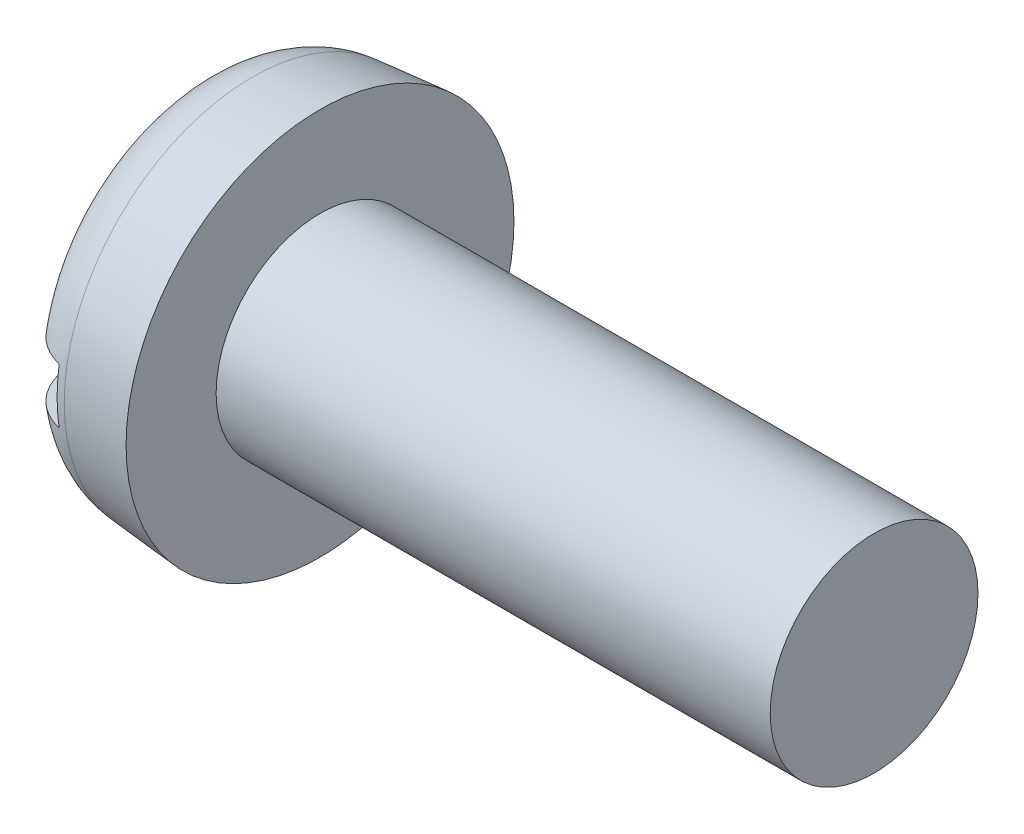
ISO-10303-21;
HEADER;
FILE_DESCRIPTION(('STEP AP214'),'2;1');
FILE_NAME('part.step','',(''),(''),'','','');
FILE_SCHEMA(('AUTOMOTIVE_DESIGN { 1 0 10303 214 1 1 1 1 }'));
ENDSEC;
DATA;
#1=APPLICATION_CONTEXT('core data for automotive mechanical design processes');
#2=APPLICATION_PROTOCOL_DEFINITION('international standard','automotive_design',2000,#1);
#3=PRODUCT_CONTEXT('',#1,'mechanical');
#4=PRODUCT('Part','Part','',(#3));
#5=PRODUCT_RELATED_PRODUCT_CATEGORY('part','',(#4));
#6=PRODUCT_DEFINITION_FORMATION('','',#4);
#7=PRODUCT_DEFINITION_CONTEXT('part definition',#1,'design');
#8=PRODUCT_DEFINITION('design','',#6,#7);
#9=PRODUCT_DEFINITION_SHAPE('','',#8);
#10=(LENGTH_UNIT() NAMED_UNIT(*) SI_UNIT(.MILLI.,.METRE.));
#11=(NAMED_UNIT(*) PLANE_ANGLE_UNIT() SI_UNIT($,.RADIAN.));
#12=(NAMED_UNIT(*) SI_UNIT($,.STERADIAN.) SOLID_ANGLE_UNIT());
#13=UNCERTAINTY_MEASURE_WITH_UNIT(LENGTH_MEASURE(1.E-05),#10,'distance_accuracy_value','');
#14=(GEOMETRIC_REPRESENTATION_CONTEXT(3) GLOBAL_UNCERTAINTY_ASSIGNED_CONTEXT((#13)) GLOBAL_UNIT_ASSIGNED_CONTEXT((#10,
#11,#12)) REPRESENTATION_CONTEXT('',''));
#15=CARTESIAN_POINT('',(0.,0.,0.));
#16=DIRECTION('',(0.,0.,1.));
#17=DIRECTION('',(1.,0.,0.));
#18=AXIS2_PLACEMENT_3D('',#15,#16,#17);
#19=CARTESIAN_POINT('',(0.,0.,0.));
#20=DIRECTION('',(-1.,0.,0.));
#21=DIRECTION('',(0.,0.,1.));
#22=AXIS2_PLACEMENT_3D('',#19,#20,#21);
#23=PLANE('',#22);
#24=DIRECTION('',(0.,0.,-1.));
#25=VECTOR('',#24,1.);
#26=CARTESIAN_POINT('',(0.,0.399999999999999,2.8));
#27=LINE('',#26,#25);
#28=CARTESIAN_POINT('',(0.,0.399999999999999,1.77326763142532));
#29=VERTEX_POINT('',#28);
#30=CARTESIAN_POINT('',(0.,0.399999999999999,-1.77326763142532));
#31=VERTEX_POINT('',#30);
#32=EDGE_CURVE('E85',#29,#31,#27,.T.);
#33=ORIENTED_EDGE('',*,*,#32,.F.);
#34=CARTESIAN_POINT('',(0.,0.,0.));
#35=DIRECTION('',(-1.,0.,0.));
#36=DIRECTION('',(0.,0.,1.));
#37=AXIS2_PLACEMENT_3D('',#34,#35,#36);
#38=CIRCLE('',#37,1.81782234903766);
#39=EDGE_CURVE('E91',#29,#31,#38,.T.);
#40=ORIENTED_EDGE('',*,*,#39,.T.);
#41=EDGE_LOOP('',(#33,#40));
#42=FACE_BOUND('',#41,.T.);
#43=ADVANCED_FACE('F32',(#42),#23,.T.);
#44=CARTESIAN_POINT('',(-25.4,0.,0.));
#45=DIRECTION('',(-1.,0.,0.));
#46=DIRECTION('',(0.,0.,1.));
#47=AXIS2_PLACEMENT_3D('',#44,#45,#46);
#48=CYLINDRICAL_SURFACE('',#47,1.5);
#49=CARTESIAN_POINT('',(9.8,0.,0.));
#50=DIRECTION('',(-1.,0.,0.));
#51=DIRECTION('',(0.,0.,1.));
#52=AXIS2_PLACEMENT_3D('',#49,#50,#51);
#53=CIRCLE('',#52,1.5);
#54=CARTESIAN_POINT('',(9.8,0.,1.5));
#55=VERTEX_POINT('',#54);
#56=EDGE_CURVE('E92',#55,#55,#53,.T.);
#57=ORIENTED_EDGE('',*,*,#56,.T.);
#58=EDGE_LOOP('',(#57));
#59=FACE_BOUND('',#58,.T.);
#60=CARTESIAN_POINT('',(1.8,0.,0.));
#61=DIRECTION('',(-1.,0.,0.));
#62=DIRECTION('',(0.,0.,1.));
#63=AXIS2_PLACEMENT_3D('',#60,#61,#62);
#64=CIRCLE('',#63,1.5);
#65=CARTESIAN_POINT('',(1.8,0.,1.5));
#66=VERTEX_POINT('',#65);
#67=EDGE_CURVE('E149',#66,#66,#64,.T.);
#68=ORIENTED_EDGE('',*,*,#67,.F.);
#69=EDGE_LOOP('',(#68));
#70=FACE_BOUND('',#69,.T.);
#71=ADVANCED_FACE('F137',(#59,#70),#48,.T.);
#72=CARTESIAN_POINT('',(9.8,1.5,0.));
#73=DIRECTION('',(1.,0.,0.));
#74=DIRECTION('',(0.,0.,-1.));
#75=AXIS2_PLACEMENT_3D('',#72,#73,#74);
#76=PLANE('',#75);
#77=ORIENTED_EDGE('',*,*,#56,.F.);
#78=EDGE_LOOP('',(#77));
#79=FACE_BOUND('',#78,.T.);
#80=ADVANCED_FACE('F135',(#79),#76,.T.);
#81=DIRECTION('',(0.,0.,1.));
#82=VECTOR('',#81,1.);
#83=CARTESIAN_POINT('',(0.,-0.4,-2.8));
#84=LINE('',#83,#82);
#85=CARTESIAN_POINT('',(0.,-0.4,-1.77326763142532));
#86=VERTEX_POINT('',#85);
#87=CARTESIAN_POINT('',(0.,-0.4,1.77326763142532));
#88=VERTEX_POINT('',#87);
#89=EDGE_CURVE('E76',#86,#88,#84,.T.);
#90=ORIENTED_EDGE('',*,*,#89,.F.);
#91=EDGE_CURVE('E83',#86,#88,#38,.T.);
#92=ORIENTED_EDGE('',*,*,#91,.T.);
#93=EDGE_LOOP('',(#90,#92));
#94=FACE_BOUND('',#93,.T.);
#95=ADVANCED_FACE('F82',(#94),#23,.T.);
#96=CARTESIAN_POINT('',(0.,0.,0.));
#97=DIRECTION('',(1.,0.,0.));
#98=DIRECTION('',(0.,0.,-1.));
#99=AXIS2_PLACEMENT_3D('',#96,#97,#98);
#100=CONICAL_SURFACE('',#99,2.64252040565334,0.087266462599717);
#101=CARTESIAN_POINT('',(0.821559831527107,0.,0.));
#102=DIRECTION('',(-1.,0.,0.));
#103=DIRECTION('',(0.,0.,1.));
#104=AXIS2_PLACEMENT_3D('',#101,#102,#103);
#105=CIRCLE('',#104,2.71439757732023);
#106=CARTESIAN_POINT('',(0.821559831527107,0.,2.71439757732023));
#107=VERTEX_POINT('',#106);
#108=EDGE_CURVE('E95',#107,#107,#105,.F.);
#109=ORIENTED_EDGE('',*,*,#108,.T.);
#110=EDGE_LOOP('',(#109));
#111=FACE_BOUND('',#110,.T.);
#112=CARTESIAN_POINT('',(1.8,0.,0.));
#113=DIRECTION('',(-1.,0.,0.));
#114=DIRECTION('',(0.,0.,1.));
#115=AXIS2_PLACEMENT_3D('',#112,#113,#114);
#116=CIRCLE('',#115,2.8);
#117=CARTESIAN_POINT('',(1.8,0.,2.8));
#118=VERTEX_POINT('',#117);
#119=EDGE_CURVE('E97',#118,#118,#116,.T.);
#120=ORIENTED_EDGE('',*,*,#119,.T.);
#121=EDGE_LOOP('',(#120));
#122=FACE_BOUND('',#121,.T.);
#123=ADVANCED_FACE('F128',(#111,#122),#100,.T.);
#124=CARTESIAN_POINT('',(1.8,1.5,0.));
#125=DIRECTION('',(-1.,0.,0.));
#126=DIRECTION('',(0.,0.,1.));
#127=AXIS2_PLACEMENT_3D('',#124,#125,#126);
#128=PLANE('',#127);
#129=ORIENTED_EDGE('',*,*,#119,.F.);
#130=EDGE_LOOP('',(#129));
#131=FACE_BOUND('',#130,.T.);
#132=ORIENTED_EDGE('',*,*,#67,.T.);
#133=EDGE_LOOP('',(#132));
#134=FACE_BOUND('',#133,.T.);
#135=ADVANCED_FACE('F124',(#131,#134),#128,.F.);
#136=CARTESIAN_POINT('',(0.9,0.,0.));
#137=DIRECTION('',(-1.,0.,0.));
#138=DIRECTION('',(0.,0.,1.));
#139=AXIS2_PLACEMENT_3D('',#136,#137,#138);
#140=TOROIDAL_SURFACE('',#139,1.81782234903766,0.9);
#141=CARTESIAN_POINT('',(0.285780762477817,0.399999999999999,-2.44311963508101));
#142=CARTESIAN_POINT('',(0.322325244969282,0.399999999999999,-2.47769297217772));
#143=CARTESIAN_POINT('',(0.361794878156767,0.399999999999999,-2.50922544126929));
#144=CARTESIAN_POINT('',(0.445493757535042,0.399999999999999,-2.56525291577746));
#145=CARTESIAN_POINT('',(0.48972822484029,0.399999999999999,-2.58974009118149));
#146=CARTESIAN_POINT('',(0.581685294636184,0.399999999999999,-2.63091846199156));
#147=CARTESIAN_POINT('',(0.629407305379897,0.399999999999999,-2.64761097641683));
#148=CARTESIAN_POINT('',(0.726972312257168,0.399999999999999,-2.67270033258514));
#149=CARTESIAN_POINT('',(0.776814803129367,0.399999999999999,-2.68109913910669));
#150=CARTESIAN_POINT('',(0.876977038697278,0.399999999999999,-2.68933922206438));
#151=CARTESIAN_POINT('',(0.92729364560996,0.399999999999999,-2.68921866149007));
#152=CARTESIAN_POINT('',(1.02719093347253,0.399999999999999,-2.68051830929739));
#153=CARTESIAN_POINT('',(1.07677160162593,0.399999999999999,-2.67193837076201));
#154=CARTESIAN_POINT('',(1.17371760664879,0.399999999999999,-2.6465919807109));
#155=CARTESIAN_POINT('',(1.2210859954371,0.399999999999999,-2.62983719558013));
#156=CARTESIAN_POINT('',(1.31235127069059,0.399999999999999,-2.58864040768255));
#157=CARTESIAN_POINT('',(1.35624813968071,0.399999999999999,-2.56419836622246));
#158=CARTESIAN_POINT('',(1.43950339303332,0.399999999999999,-2.50824069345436));
#159=CARTESIAN_POINT('',(1.47884484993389,0.399999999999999,-2.47669988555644));
#160=CARTESIAN_POINT('',(1.55173067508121,0.399999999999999,-2.40751412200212));
#161=CARTESIAN_POINT('',(1.5852748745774,0.399999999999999,-2.36986898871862));
#162=CARTESIAN_POINT('',(1.64594872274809,0.399999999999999,-2.28919528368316));
#163=CARTESIAN_POINT('',(1.67301846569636,0.399999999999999,-2.24612167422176));
#164=CARTESIAN_POINT('',(1.71966197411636,0.399999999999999,-2.15609376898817));
#165=CARTESIAN_POINT('',(1.73923530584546,0.399999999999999,-2.10913924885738));
#166=CARTESIAN_POINT('',(1.77066025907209,0.399999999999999,-2.01194193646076));
#167=CARTESIAN_POINT('',(1.78239254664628,0.399999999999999,-1.96166058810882));
#168=CARTESIAN_POINT('',(1.7974373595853,0.399999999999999,-1.85985639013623));
#169=CARTESIAN_POINT('',(1.80074908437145,0.399999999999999,-1.80833342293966));
#170=CARTESIAN_POINT('',(1.79894832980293,0.399999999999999,-1.70434405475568));
#171=CARTESIAN_POINT('',(1.79365584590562,0.399999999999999,-1.651880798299));
#172=CARTESIAN_POINT('',(1.77456092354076,0.399999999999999,-1.54852841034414));
#173=CARTESIAN_POINT('',(1.76075741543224,0.399999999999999,-1.49763947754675));
#174=CARTESIAN_POINT('',(1.7246504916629,0.399999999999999,-1.3975266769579));
#175=CARTESIAN_POINT('',(1.70214283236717,0.399999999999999,-1.34837644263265));
#176=CARTESIAN_POINT('',(1.64933120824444,0.399999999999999,-1.25444995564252));
#177=CARTESIAN_POINT('',(1.6190255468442,0.399999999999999,-1.20967465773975));
#178=CARTESIAN_POINT('',(1.55085214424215,0.399999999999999,-1.12504927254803));
#179=CARTESIAN_POINT('',(1.51286662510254,0.399999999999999,-1.08529386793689));
#180=CARTESIAN_POINT('',(1.4306134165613,0.399999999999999,-1.01288372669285));
#181=CARTESIAN_POINT('',(1.38634513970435,0.399999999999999,-0.980229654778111));
#182=CARTESIAN_POINT('',(1.29378824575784,0.399999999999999,-0.924048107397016));
#183=CARTESIAN_POINT('',(1.24562231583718,0.399999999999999,-0.900319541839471));
#184=CARTESIAN_POINT('',(1.14574424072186,0.399999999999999,-0.862177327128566));
#185=CARTESIAN_POINT('',(1.09403573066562,0.399999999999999,-0.847754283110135));
#186=CARTESIAN_POINT('',(0.993395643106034,0.399999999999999,-0.830011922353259));
#187=CARTESIAN_POINT('',(0.944615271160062,0.399999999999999,-0.825833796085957));
#188=CARTESIAN_POINT('',(0.847107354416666,0.399999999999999,-0.826334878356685));
#189=CARTESIAN_POINT('',(0.798379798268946,0.399999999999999,-0.831011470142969));
#190=CARTESIAN_POINT('',(0.705495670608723,0.399999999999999,-0.848340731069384));
#191=CARTESIAN_POINT('',(0.661242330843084,0.399999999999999,-0.860484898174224));
#192=CARTESIAN_POINT('',(0.575232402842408,0.399999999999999,-0.891650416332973));
#193=CARTESIAN_POINT('',(0.53347652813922,0.399999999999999,-0.910673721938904));
#194=CARTESIAN_POINT('',(0.451191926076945,0.399999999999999,-0.956010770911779));
#195=CARTESIAN_POINT('',(0.410848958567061,0.399999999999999,-0.982660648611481));
#196=CARTESIAN_POINT('',(0.334722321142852,0.399999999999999,-1.04182188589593));
#197=CARTESIAN_POINT('',(0.298940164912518,0.399999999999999,-1.0743351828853));
#198=CARTESIAN_POINT('',(0.229649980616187,0.399999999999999,-1.14749226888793));
#199=CARTESIAN_POINT('',(0.19663491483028,0.399999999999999,-1.18860403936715));
#200=CARTESIAN_POINT('',(0.137645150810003,0.399999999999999,-1.27560624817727));
#201=CARTESIAN_POINT('',(0.111672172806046,0.399999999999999,-1.32149785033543));
#202=CARTESIAN_POINT('',(0.0665593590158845,0.399999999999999,-1.41881690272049));
#203=CARTESIAN_POINT('',(0.0477401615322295,0.399999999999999,-1.47039354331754));
#204=CARTESIAN_POINT('',(0.0191028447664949,0.399999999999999,-1.57598967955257));
#205=CARTESIAN_POINT('',(0.0092842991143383,0.399999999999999,-1.63000905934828));
#206=CARTESIAN_POINT('',(-0.000908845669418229,0.399999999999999,-1.73850050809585));
#207=CARTESIAN_POINT('',(-0.00135843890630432,0.399999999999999,-1.7929654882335));
#208=CARTESIAN_POINT('',(0.00713794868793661,0.399999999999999,-1.90117587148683));
#209=CARTESIAN_POINT('',(0.0160852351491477,0.399999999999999,-1.9549211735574));
#210=CARTESIAN_POINT('',(0.0428869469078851,0.399999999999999,-2.05874477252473));
#211=CARTESIAN_POINT('',(0.0605196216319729,0.399999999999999,-2.10888044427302));
#212=CARTESIAN_POINT('',(0.104140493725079,0.399999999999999,-2.20532358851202));
#213=CARTESIAN_POINT('',(0.130117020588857,0.399999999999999,-2.25163629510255));
#214=CARTESIAN_POINT('',(0.178150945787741,0.399999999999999,-2.32211375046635));
#215=CARTESIAN_POINT('',(0.197843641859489,0.399999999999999,-2.34792122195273));
#216=CARTESIAN_POINT('',(0.239879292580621,0.399999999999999,-2.39728022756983));
#217=CARTESIAN_POINT('',(0.26222221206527,0.399999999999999,-2.42083179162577));
#218=CARTESIAN_POINT('',(0.285780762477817,0.399999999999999,-2.44311963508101));
#219=B_SPLINE_CURVE_WITH_KNOTS('',3,(#141,#142,#143,#144,#145,#146,#147,#148,#149,#150,#151,
#152,#153,#154,#155,#156,#157,#158,#159,#160,#161,#162,#163,#164,#165,#166,#167,#168,#169,#170,
#171,#172,#173,#174,#175,#176,#177,#178,#179,#180,#181,#182,#183,#184,#185,#186,#187,#188,#189,
#190,#191,#192,#193,#194,#195,#196,#197,#198,#199,#200,#201,#202,#203,#204,#205,#206,#207,#208,
#209,#210,#211,#212,#213,#214,#215,#216,#217,#218),.UNSPECIFIED.,.T.,.F.,(4,2,2,2,2,2,2,2,2,2,2,
2,2,2,2,2,2,2,2,2,2,2,2,2,2,2,2,2,2,2,2,2,2,2,2,2,2,2,4),(0.,0.15080428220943,0.301775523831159,
0.452721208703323,0.603631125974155,0.753865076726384,0.904101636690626,1.05412441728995,
1.2041479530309,1.35471219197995,1.50528081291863,1.65719291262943,1.80911380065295,
1.96329712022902,2.11749509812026,2.27496068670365,2.43244606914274,2.59387611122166,
2.75534130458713,2.9195015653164,3.08367718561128,3.24389389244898,3.40394859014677,
3.55004213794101,3.69609251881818,3.83315592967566,3.97025831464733,4.11470991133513,
4.25920932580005,4.41668805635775,4.57420522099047,4.73812462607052,4.90203626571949,
5.06463536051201,5.22725705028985,5.38592661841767,5.54437521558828,5.64159310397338,
5.73880970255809),.UNSPECIFIED.);
#220=CARTESIAN_POINT('',(0.7,0.399999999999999,-2.66547244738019));
#221=VERTEX_POINT('',#220);
#222=EDGE_CURVE('E11',#31,#221,#219,.T.);
#223=ORIENTED_EDGE('',*,*,#222,.F.);
#224=ORIENTED_EDGE('',*,*,#39,.F.);
#225=CARTESIAN_POINT('',(0.356169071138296,0.399999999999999,1.02545886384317));
#226=CARTESIAN_POINT('',(0.394477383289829,0.399999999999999,0.994276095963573));
#227=CARTESIAN_POINT('',(0.435252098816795,0.399999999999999,0.966090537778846));
#228=CARTESIAN_POINT('',(0.520874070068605,0.399999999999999,0.916713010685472));
#229=CARTESIAN_POINT('',(0.56572297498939,0.399999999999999,0.895523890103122));
#230=CARTESIAN_POINT('',(0.658585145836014,0.399999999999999,0.861072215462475));
#231=CARTESIAN_POINT('',(0.706609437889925,0.399999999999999,0.84783908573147));
#232=CARTESIAN_POINT('',(0.80424325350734,0.399999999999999,0.83024223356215));
#233=CARTESIAN_POINT('',(0.853851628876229,0.399999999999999,0.825872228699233));
#234=CARTESIAN_POINT('',(0.950010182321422,0.399999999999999,0.826277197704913));
#235=CARTESIAN_POINT('',(0.99656347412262,0.399999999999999,0.830513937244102));
#236=CARTESIAN_POINT('',(1.08828168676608,0.399999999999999,0.846797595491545));
#237=CARTESIAN_POINT('',(1.1334463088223,0.399999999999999,0.858846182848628));
#238=CARTESIAN_POINT('',(1.22099947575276,0.399999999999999,0.890027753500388));
#239=CARTESIAN_POINT('',(1.26339999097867,0.399999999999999,0.909127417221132));
#240=CARTESIAN_POINT('',(1.34475562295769,0.399999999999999,0.953613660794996));
#241=CARTESIAN_POINT('',(1.38370973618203,0.399999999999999,0.979002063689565));
#242=CARTESIAN_POINT('',(1.4606297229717,0.399999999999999,1.03768873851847));
#243=CARTESIAN_POINT('',(1.49821861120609,0.399999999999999,1.07148126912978));
#244=CARTESIAN_POINT('',(1.56766557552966,0.399999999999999,1.14451739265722));
#245=CARTESIAN_POINT('',(1.59952174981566,0.399999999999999,1.18376278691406));
#246=CARTESIAN_POINT('',(1.65882951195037,0.399999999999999,1.26965174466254));
#247=CARTESIAN_POINT('',(1.68580874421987,0.399999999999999,1.3166225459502));
#248=CARTESIAN_POINT('',(1.7316261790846,0.399999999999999,1.41438438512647));
#249=CARTESIAN_POINT('',(1.7504634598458,0.399999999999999,1.46517585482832));
#250=CARTESIAN_POINT('',(1.77959171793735,0.399999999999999,1.56990546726));
#251=CARTESIAN_POINT('',(1.78976336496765,0.399999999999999,1.62387693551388));
#252=CARTESIAN_POINT('',(1.80070617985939,0.399999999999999,1.73276786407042));
#253=CARTESIAN_POINT('',(1.80147810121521,0.399999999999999,1.78768724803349));
#254=CARTESIAN_POINT('',(1.7935515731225,0.399999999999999,1.89576039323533));
#255=CARTESIAN_POINT('',(1.78503812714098,0.399999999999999,1.94892767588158));
#256=CARTESIAN_POINT('',(1.75897009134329,0.399999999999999,2.05299963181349));
#257=CARTESIAN_POINT('',(1.74141670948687,0.399999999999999,2.10390460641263));
#258=CARTESIAN_POINT('',(1.69825810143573,0.399999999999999,2.20064023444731));
#259=CARTESIAN_POINT('',(1.67286703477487,0.399999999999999,2.24656646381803));
#260=CARTESIAN_POINT('',(1.61458416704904,0.399999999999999,2.33338474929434));
#261=CARTESIAN_POINT('',(1.58169323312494,0.399999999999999,2.37427738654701));
#262=CARTESIAN_POINT('',(1.51007060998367,0.399999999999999,2.44900649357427));
#263=CARTESIAN_POINT('',(1.47146964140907,0.399999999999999,2.48296829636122));
#264=CARTESIAN_POINT('',(1.38904817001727,0.399999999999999,2.54382334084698));
#265=CARTESIAN_POINT('',(1.34522808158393,0.399999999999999,2.57071714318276));
#266=CARTESIAN_POINT('',(1.25424836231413,0.399999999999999,2.61630908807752));
#267=CARTESIAN_POINT('',(1.20714119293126,0.399999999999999,2.63511196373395));
#268=CARTESIAN_POINT('',(1.11042474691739,0.399999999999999,2.66447616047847));
#269=CARTESIAN_POINT('',(1.06081558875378,0.399999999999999,2.67503787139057));
#270=CARTESIAN_POINT('',(0.960893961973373,0.399999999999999,2.68755622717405));
#271=CARTESIAN_POINT('',(0.910589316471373,0.399999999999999,2.68957539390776));
#272=CARTESIAN_POINT('',(0.810358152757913,0.399999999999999,2.68512046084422));
#273=CARTESIAN_POINT('',(0.760431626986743,0.399999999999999,2.67864653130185));
#274=CARTESIAN_POINT('',(0.662478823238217,0.399999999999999,2.65741995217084));
#275=CARTESIAN_POINT('',(0.614448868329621,0.399999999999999,2.64268425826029));
#276=CARTESIAN_POINT('',(0.521534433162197,0.399999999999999,2.60538142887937));
#277=CARTESIAN_POINT('',(0.476649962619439,0.399999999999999,2.58281426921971));
#278=CARTESIAN_POINT('',(0.391148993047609,0.399999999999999,2.53043182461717));
#279=CARTESIAN_POINT('',(0.350545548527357,0.399999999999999,2.50059523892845));
#280=CARTESIAN_POINT('',(0.274874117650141,0.399999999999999,2.43457977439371));
#281=CARTESIAN_POINT('',(0.239806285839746,0.399999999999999,2.39840071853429));
#282=CARTESIAN_POINT('',(0.1758792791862,0.399999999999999,2.32042102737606));
#283=CARTESIAN_POINT('',(0.147073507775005,0.399999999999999,2.27857662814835));
#284=CARTESIAN_POINT('',(0.0967847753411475,0.399999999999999,2.19069995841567));
#285=CARTESIAN_POINT('',(0.07530224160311,0.399999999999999,2.14466744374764));
#286=CARTESIAN_POINT('',(0.0399276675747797,0.399999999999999,2.04903409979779));
#287=CARTESIAN_POINT('',(0.0261471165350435,0.399999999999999,1.99939205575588));
#288=CARTESIAN_POINT('',(0.00693602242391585,0.399999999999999,1.89852251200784));
#289=CARTESIAN_POINT('',(0.00150590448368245,0.399999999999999,1.84729493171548));
#290=CARTESIAN_POINT('',(-0.000985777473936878,0.399999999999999,1.74359522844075));
#291=CARTESIAN_POINT('',(0.0021251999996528,0.399999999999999,1.69111899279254));
#292=CARTESIAN_POINT('',(0.0168916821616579,0.399999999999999,1.58737297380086));
#293=CARTESIAN_POINT('',(0.0285499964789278,0.399999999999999,1.53610359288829));
#294=CARTESIAN_POINT('',(0.0604020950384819,0.399999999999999,1.43486374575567));
#295=CARTESIAN_POINT('',(0.080804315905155,0.399999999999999,1.38495893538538));
#296=CARTESIAN_POINT('',(0.129530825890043,0.399999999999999,1.28921347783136));
#297=CARTESIAN_POINT('',(0.157849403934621,0.399999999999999,1.24336993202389));
#298=CARTESIAN_POINT('',(0.213684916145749,0.399999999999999,1.16773658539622));
#299=CARTESIAN_POINT('',(0.239651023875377,0.399999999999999,1.13678903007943));
#300=CARTESIAN_POINT('',(0.29525297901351,0.399999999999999,1.07838116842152));
#301=CARTESIAN_POINT('',(0.324888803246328,0.399999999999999,1.05092084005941));
#302=CARTESIAN_POINT('',(0.356169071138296,0.399999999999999,1.02545886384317));
#303=B_SPLINE_CURVE_WITH_KNOTS('',3,(#225,#226,#227,#228,#229,#230,#231,#232,#233,#234,#235,
#236,#237,#238,#239,#240,#241,#242,#243,#244,#245,#246,#247,#248,#249,#250,#251,#252,#253,#254,
#255,#256,#257,#258,#259,#260,#261,#262,#263,#264,#265,#266,#267,#268,#269,#270,#271,#272,#273,
#274,#275,#276,#277,#278,#279,#280,#281,#282,#283,#284,#285,#286,#287,#288,#289,#290,#291,#292,
#293,#294,#295,#296,#297,#298,#299,#300,#301,#302),.UNSPECIFIED.,.T.,.F.,(4,2,2,2,2,2,2,2,2,2,2,
2,2,2,2,2,2,2,2,2,2,2,2,2,2,2,2,2,2,2,2,2,2,2,2,2,2,2,4),(0.,0.148056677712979,
0.296173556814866,0.444834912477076,0.593390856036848,0.732942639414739,0.87252424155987,
1.01145452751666,1.15042513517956,1.30141738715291,1.45245963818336,1.61420969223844,
1.7759780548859,1.93993961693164,2.10388803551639,2.26462860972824,2.42534771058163,
2.58201478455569,2.73866375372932,2.89216335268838,3.04565077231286,3.19708679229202,
3.34851564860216,3.49883427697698,3.64914989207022,3.79915813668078,3.94916684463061,
4.09962050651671,4.25007836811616,4.40177296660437,4.55347641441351,4.70732244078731,
4.86117629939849,5.0181609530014,5.17519723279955,5.33620557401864,5.49709805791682,
5.61799301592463,5.73888721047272),.UNSPECIFIED.);
#304=CARTESIAN_POINT('',(0.7,0.399999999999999,2.66547244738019));
#305=VERTEX_POINT('',#304);
#306=EDGE_CURVE('E109',#305,#29,#303,.T.);
#307=ORIENTED_EDGE('',*,*,#306,.F.);
#308=CARTESIAN_POINT('',(0.7,0.,0.));
#309=DIRECTION('',(-1.,0.,0.));
#310=DIRECTION('',(0.,0.,1.));
#311=AXIS2_PLACEMENT_3D('',#308,#309,#310);
#312=CIRCLE('',#311,2.69531878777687);
#313=CARTESIAN_POINT('',(0.7,-0.4,2.66547244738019));
#314=VERTEX_POINT('',#313);
#315=EDGE_CURVE('E103',#305,#314,#312,.F.);
#316=ORIENTED_EDGE('',*,*,#315,.T.);
#317=CARTESIAN_POINT('',(0.356169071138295,-0.4,1.02545886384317));
#318=CARTESIAN_POINT('',(0.314031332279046,-0.4,1.05976167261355));
#319=CARTESIAN_POINT('',(0.274819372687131,-0.4,1.0977427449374));
#320=CARTESIAN_POINT('',(0.20326819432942,-0.4,1.17978565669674));
#321=CARTESIAN_POINT('',(0.170942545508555,-0.4,1.22385922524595));
#322=CARTESIAN_POINT('',(0.114111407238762,-0.4,1.31672727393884));
#323=CARTESIAN_POINT('',(0.0895968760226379,-0.4,1.36551620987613));
#324=CARTESIAN_POINT('',(0.0490785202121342,-0.4,1.46648183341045));
#325=CARTESIAN_POINT('',(0.0330703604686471,-0.4,1.51865678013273));
#326=CARTESIAN_POINT('',(0.0100453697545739,-0.4,1.62518908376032));
#327=CARTESIAN_POINT('',(0.00306618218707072,-0.4,1.67955460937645));
#328=CARTESIAN_POINT('',(-0.00144685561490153,-0.4,1.78868546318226));
#329=CARTESIAN_POINT('',(0.00101939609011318,-0.4,1.84345079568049));
#330=CARTESIAN_POINT('',(0.0152891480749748,-0.4,1.95052330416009));
#331=CARTESIAN_POINT('',(0.0268854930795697,-0.4,2.0028580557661));
#332=CARTESIAN_POINT('',(0.0589248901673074,-0.4,2.10474672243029));
#333=CARTESIAN_POINT('',(0.0793666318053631,-0.4,2.15430104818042));
#334=CARTESIAN_POINT('',(0.12795627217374,-0.4,2.24792186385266));
#335=CARTESIAN_POINT('',(0.155901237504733,-0.4,2.29209371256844));
#336=CARTESIAN_POINT('',(0.218944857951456,-0.4,2.37499861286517));
#337=CARTESIAN_POINT('',(0.254042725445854,-0.4,2.41373226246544));
#338=CARTESIAN_POINT('',(0.32966685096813,-0.4,2.48389534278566));
#339=CARTESIAN_POINT('',(0.370077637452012,-0.4,2.51544927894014));
#340=CARTESIAN_POINT('',(0.455677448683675,-0.4,2.57122459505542));
#341=CARTESIAN_POINT('',(0.500866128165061,-0.4,2.59544650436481));
#342=CARTESIAN_POINT('',(0.59413782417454,-0.4,2.6355729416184));
#343=CARTESIAN_POINT('',(0.642178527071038,-0.4,2.65157587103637));
#344=CARTESIAN_POINT('',(0.740273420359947,-0.4,2.67523109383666));
#345=CARTESIAN_POINT('',(0.790327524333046,-0.4,2.68288374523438));
#346=CARTESIAN_POINT('',(0.890686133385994,-0.4,2.68958762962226));
#347=CARTESIAN_POINT('',(0.940986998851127,-0.4,2.68869347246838));
#348=CARTESIAN_POINT('',(1.04072178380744,-0.4,2.67846167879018));
#349=CARTESIAN_POINT('',(1.0901557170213,-0.4,2.66912417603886));
#350=CARTESIAN_POINT('',(1.18669599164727,-0.4,2.64229877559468));
#351=CARTESIAN_POINT('',(1.23380501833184,-0.4,2.6248205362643));
#352=CARTESIAN_POINT('',(1.32443528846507,-0.4,2.58223220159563));
#353=CARTESIAN_POINT('',(1.36795650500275,-0.4,2.5571220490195));
#354=CARTESIAN_POINT('',(1.45036421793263,-0.4,2.49989362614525));
#355=CARTESIAN_POINT('',(1.48923230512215,-0.4,2.46774885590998));
#356=CARTESIAN_POINT('',(1.56107927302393,-0.4,2.39744378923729));
#357=CARTESIAN_POINT('',(1.59405796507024,-0.4,2.35928330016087));
#358=CARTESIAN_POINT('',(1.65352847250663,-0.4,2.2776666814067));
#359=CARTESIAN_POINT('',(1.67995797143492,-0.4,2.23416516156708));
#360=CARTESIAN_POINT('',(1.72526137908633,-0.4,2.14339421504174));
#361=CARTESIAN_POINT('',(1.74413484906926,-0.4,2.09612456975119));
#362=CARTESIAN_POINT('',(1.77411508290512,-0.4,1.9983989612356));
#363=CARTESIAN_POINT('',(1.78509960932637,-0.4,1.9479055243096));
#364=CARTESIAN_POINT('',(1.79862667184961,-0.4,1.84580292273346));
#365=CARTESIAN_POINT('',(1.80116838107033,-0.4,1.79419364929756));
#366=CARTESIAN_POINT('',(1.79780993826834,-0.4,1.69014314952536));
#367=CARTESIAN_POINT('',(1.79172746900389,-0.4,1.63770783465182));
#368=CARTESIAN_POINT('',(1.77106806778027,-0.4,1.53454005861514));
#369=CARTESIAN_POINT('',(1.75649007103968,-0.4,1.48380781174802));
#370=CARTESIAN_POINT('',(1.7188487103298,-0.4,1.38413781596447));
#371=CARTESIAN_POINT('',(1.69558194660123,-0.4,1.33527684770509));
#372=CARTESIAN_POINT('',(1.64130257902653,-0.4,1.24205401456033));
#373=CARTESIAN_POINT('',(1.6102882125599,-0.4,1.19769317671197));
#374=CARTESIAN_POINT('',(1.54078360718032,-0.4,1.11407031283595));
#375=CARTESIAN_POINT('',(1.50218355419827,-0.4,1.07489936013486));
#376=CARTESIAN_POINT('',(1.418793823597,-0.4,1.00377929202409));
#377=CARTESIAN_POINT('',(1.37400377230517,-0.4,0.971830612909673));
#378=CARTESIAN_POINT('',(1.28066227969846,-0.4,0.917245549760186));
#379=CARTESIAN_POINT('',(1.23224470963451,-0.4,0.894381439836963));
#380=CARTESIAN_POINT('',(1.13202516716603,-0.4,0.858023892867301));
#381=CARTESIAN_POINT('',(1.08022692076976,-0.4,0.844520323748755));
#382=CARTESIAN_POINT('',(0.979686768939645,-0.4,0.828554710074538));
#383=CARTESIAN_POINT('',(0.93108358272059,-0.4,0.82521631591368));
#384=CARTESIAN_POINT('',(0.834057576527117,-0.4,0.827306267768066));
#385=CARTESIAN_POINT('',(0.785634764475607,-0.4,0.832734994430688));
#386=CARTESIAN_POINT('',(0.693219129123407,-0.4,0.851440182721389));
#387=CARTESIAN_POINT('',(0.6491307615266,-0.4,0.864254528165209));
#388=CARTESIAN_POINT('',(0.563580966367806,-0.4,0.896690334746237));
#389=CARTESIAN_POINT('',(0.522117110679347,-0.4,0.916305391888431));
#390=CARTESIAN_POINT('',(0.460201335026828,-0.4,0.951554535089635));
#391=CARTESIAN_POINT('',(0.438547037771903,-0.4,0.965129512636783));
#392=CARTESIAN_POINT('',(0.396436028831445,-0.4,0.994018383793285));
#393=CARTESIAN_POINT('',(0.375979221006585,-0.4,1.00933213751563));
#394=CARTESIAN_POINT('',(0.356169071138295,-0.4,1.02545886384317));
#395=B_SPLINE_CURVE_WITH_KNOTS('',3,(#317,#318,#319,#320,#321,#322,#323,#324,#325,#326,#327,
#328,#329,#330,#331,#332,#333,#334,#335,#336,#337,#338,#339,#340,#341,#342,#343,#344,#345,#346,
#347,#348,#349,#350,#351,#352,#353,#354,#355,#356,#357,#358,#359,#360,#361,#362,#363,#364,#365,
#366,#367,#368,#369,#370,#371,#372,#373,#374,#375,#376,#377,#378,#379,#380,#381,#382,#383,#384,
#385,#386,#387,#388,#389,#390,#391,#392,#393,#394),.UNSPECIFIED.,.T.,.F.,(4,2,2,2,2,2,2,2,2,2,2,
2,2,2,2,2,2,2,2,2,2,2,2,2,2,2,2,2,2,2,2,2,2,2,2,2,2,2,4),(0.,0.162908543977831,
0.326135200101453,0.489172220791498,0.652126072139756,0.815757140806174,0.979389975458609,
1.13941349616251,1.29941331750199,1.45545894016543,1.61148738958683,1.76455910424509,
1.91761976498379,2.068802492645,2.21997873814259,2.37018969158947,2.52039826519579,
2.67042907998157,2.82046101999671,2.97106818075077,3.12168016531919,3.27367450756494,
3.42567767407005,3.5799880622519,3.73431356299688,3.89195060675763,4.04960741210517,
4.2112132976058,4.37285598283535,4.53703863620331,4.70123120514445,4.86099956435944,
5.02059471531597,5.16597452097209,5.31136063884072,5.44850857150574,5.58552770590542,
5.66212180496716,5.73870974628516),.UNSPECIFIED.);
#396=EDGE_CURVE('E90',#88,#314,#395,.T.);
#397=ORIENTED_EDGE('',*,*,#396,.F.);
#398=ORIENTED_EDGE('',*,*,#91,.F.);
#399=CARTESIAN_POINT('',(0.285780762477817,-0.4,-2.44311963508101));
#400=CARTESIAN_POINT('',(0.248557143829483,-0.4,-2.4078972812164));
#401=CARTESIAN_POINT('',(0.214312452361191,-0.4,-2.3694650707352));
#402=CARTESIAN_POINT('',(0.152768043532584,-0.4,-2.28733938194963));
#403=CARTESIAN_POINT('',(0.125478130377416,-0.4,-2.24363860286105));
#404=CARTESIAN_POINT('',(0.0786257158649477,-0.4,-2.15234079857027));
#405=CARTESIAN_POINT('',(0.0590537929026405,-0.4,-2.10474861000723));
#406=CARTESIAN_POINT('',(0.0280650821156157,-0.4,-2.00700047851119));
#407=CARTESIAN_POINT('',(0.0166461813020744,-0.4,-1.95684520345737));
#408=CARTESIAN_POINT('',(0.00206923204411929,-0.4,-1.85464080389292));
#409=CARTESIAN_POINT('',(-0.000972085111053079,-0.4,-1.80257506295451));
#410=CARTESIAN_POINT('',(0.00151453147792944,-0.4,-1.69864852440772));
#411=CARTESIAN_POINT('',(0.00704382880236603,-0.4,-1.64678776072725));
#412=CARTESIAN_POINT('',(0.0266516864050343,-0.4,-1.5434240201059));
#413=CARTESIAN_POINT('',(0.0409314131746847,-0.4,-1.49195921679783));
#414=CARTESIAN_POINT('',(0.0777275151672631,-0.4,-1.39206285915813));
#415=CARTESIAN_POINT('',(0.100245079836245,-0.4,-1.34363174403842));
#416=CARTESIAN_POINT('',(0.153482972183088,-0.4,-1.2500005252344));
#417=CARTESIAN_POINT('',(0.184382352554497,-0.4,-1.20490211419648));
#418=CARTESIAN_POINT('',(0.253306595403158,-0.4,-1.12049761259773));
#419=CARTESIAN_POINT('',(0.29133345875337,-0.4,-1.08119315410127));
#420=CARTESIAN_POINT('',(0.373599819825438,-0.4,-1.00962170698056));
#421=CARTESIAN_POINT('',(0.417845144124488,-0.4,-0.977361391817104));
#422=CARTESIAN_POINT('',(0.511393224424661,-0.4,-0.921257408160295));
#423=CARTESIAN_POINT('',(0.560693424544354,-0.4,-0.897409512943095));
#424=CARTESIAN_POINT('',(0.659899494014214,-0.4,-0.86056620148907));
#425=CARTESIAN_POINT('',(0.709596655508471,-0.4,-0.847011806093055));
#426=CARTESIAN_POINT('',(0.81063175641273,-0.4,-0.829407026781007));
#427=CARTESIAN_POINT('',(0.861968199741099,-0.4,-0.825348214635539));
#428=CARTESIAN_POINT('',(0.959752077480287,-0.4,-0.82693832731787));
#429=CARTESIAN_POINT('',(1.00621575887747,-0.4,-0.831730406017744));
#430=CARTESIAN_POINT('',(1.09766854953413,-0.4,-0.849077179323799));
#431=CARTESIAN_POINT('',(1.14265739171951,-0.4,-0.861633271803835));
#432=CARTESIAN_POINT('',(1.2299114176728,-0.4,-0.893807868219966));
#433=CARTESIAN_POINT('',(1.27218175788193,-0.4,-0.913412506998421));
#434=CARTESIAN_POINT('',(1.35320643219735,-0.4,-0.958874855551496));
#435=CARTESIAN_POINT('',(1.39195973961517,-0.4,-0.984734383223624));
#436=CARTESIAN_POINT('',(1.46843970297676,-0.4,-1.04440221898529));
#437=CARTESIAN_POINT('',(1.5057776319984,-0.4,-1.07870901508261));
#438=CARTESIAN_POINT('',(1.57463408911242,-0.4,-1.15273784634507));
#439=CARTESIAN_POINT('',(1.60615068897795,-0.4,-1.19246166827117));
#440=CARTESIAN_POINT('',(1.66460952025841,-0.4,-1.27921419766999));
#441=CARTESIAN_POINT('',(1.69108592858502,-0.4,-1.32655784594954));
#442=CARTESIAN_POINT('',(1.73582713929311,-0.4,-1.42498260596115));
#443=CARTESIAN_POINT('',(1.75409110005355,-0.4,-1.47606410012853));
#444=CARTESIAN_POINT('',(1.7819800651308,-0.4,-1.58118959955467));
#445=CARTESIAN_POINT('',(1.79150042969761,-0.4,-1.63526148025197));
#446=CARTESIAN_POINT('',(1.80112725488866,-0.4,-1.74424014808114));
#447=CARTESIAN_POINT('',(1.80123449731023,-0.4,-1.79914686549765));
#448=CARTESIAN_POINT('',(1.79200090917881,-0.4,-1.90704889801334));
#449=CARTESIAN_POINT('',(1.78285023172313,-0.4,-1.96006044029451));
#450=CARTESIAN_POINT('',(1.75554489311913,-0.4,-2.06371351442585));
#451=CARTESIAN_POINT('',(1.73739144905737,-0.4,-2.11435536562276));
#452=CARTESIAN_POINT('',(1.69310212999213,-0.4,-2.21047686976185));
#453=CARTESIAN_POINT('',(1.66717834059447,-0.4,-2.25605427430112));
#454=CARTESIAN_POINT('',(1.60789945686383,-0.4,-2.34209023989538));
#455=CARTESIAN_POINT('',(1.57454519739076,-0.4,-2.38254937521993));
#456=CARTESIAN_POINT('',(1.50207992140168,-0.4,-2.45635864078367));
#457=CARTESIAN_POINT('',(1.46309647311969,-0.4,-2.48983406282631));
#458=CARTESIAN_POINT('',(1.37999946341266,-0.4,-2.54966020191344));
#459=CARTESIAN_POINT('',(1.33588629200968,-0.4,-2.57601146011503));
#460=CARTESIAN_POINT('',(1.24441048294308,-0.4,-2.6204920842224));
#461=CARTESIAN_POINT('',(1.19709806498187,-0.4,-2.63872477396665));
#462=CARTESIAN_POINT('',(1.10007286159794,-0.4,-2.66692299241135));
#463=CARTESIAN_POINT('',(1.05036028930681,-0.4,-2.67688925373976));
#464=CARTESIAN_POINT('',(0.950330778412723,-0.4,-2.68821568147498));
#465=CARTESIAN_POINT('',(0.900020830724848,-0.4,-2.68963769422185));
#466=CARTESIAN_POINT('',(0.799864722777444,-0.4,-2.68399705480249));
#467=CARTESIAN_POINT('',(0.75001868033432,-0.4,-2.67693230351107));
#468=CARTESIAN_POINT('',(0.652295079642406,-0.4,-2.6545442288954));
#469=CARTESIAN_POINT('',(0.6044149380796,-0.4,-2.63923214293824));
#470=CARTESIAN_POINT('',(0.511939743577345,-0.4,-2.60081753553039));
#471=CARTESIAN_POINT('',(0.467340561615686,-0.4,-2.5777250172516));
#472=CARTESIAN_POINT('',(0.40010178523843,-0.4,-2.53543999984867));
#473=CARTESIAN_POINT('',(0.375979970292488,-0.4,-2.51855507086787));
#474=CARTESIAN_POINT('',(0.329505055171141,-0.4,-2.48250598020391));
#475=CARTESIAN_POINT('',(0.307151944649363,-0.4,-2.46334183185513));
#476=CARTESIAN_POINT('',(0.285780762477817,-0.4,-2.44311963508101));
#477=B_SPLINE_CURVE_WITH_KNOTS('',3,(#399,#400,#401,#402,#403,#404,#405,#406,#407,#408,#409,
#410,#411,#412,#413,#414,#415,#416,#417,#418,#419,#420,#421,#422,#423,#424,#425,#426,#427,#428,
#429,#430,#431,#432,#433,#434,#435,#436,#437,#438,#439,#440,#441,#442,#443,#444,#445,#446,#447,
#448,#449,#450,#451,#452,#453,#454,#455,#456,#457,#458,#459,#460,#461,#462,#463,#464,#465,#466,
#467,#468,#469,#470,#471,#472,#473,#474,#475,#476),.UNSPECIFIED.,.T.,.F.,(4,2,2,2,2,2,2,2,2,2,2,
2,2,2,2,2,2,2,2,2,2,2,2,2,2,2,2,2,2,2,2,2,2,2,2,2,2,2,4),(0.,0.153630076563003,0.30747554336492,
0.461132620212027,0.614749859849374,0.770496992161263,0.926268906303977,1.08576372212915,
1.24528157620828,1.40851960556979,1.57180352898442,1.73524147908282,1.89859719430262,
2.05228040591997,2.205827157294,2.34528036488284,2.48475868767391,2.62396413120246,
2.7632100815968,2.91467905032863,3.06619810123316,3.22817436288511,3.39016722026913,
3.55407439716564,3.71796796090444,3.87856222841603,4.03913479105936,4.19567175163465,
4.35219113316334,4.50560019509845,4.65899760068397,4.81038266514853,4.96175431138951,
5.1120289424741,5.26234075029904,5.41244826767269,5.56236352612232,5.65056762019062,
5.73877119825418),.UNSPECIFIED.);
#478=CARTESIAN_POINT('',(0.7,-0.4,-2.66547244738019));
#479=VERTEX_POINT('',#478);
#480=EDGE_CURVE('E44',#479,#86,#477,.T.);
#481=ORIENTED_EDGE('',*,*,#480,.F.);
#482=EDGE_CURVE('E56',#479,#221,#312,.F.);
#483=ORIENTED_EDGE('',*,*,#482,.T.);
#484=EDGE_LOOP('',(#223,#224,#307,#316,#397,#398,#481,#483));
#485=FACE_BOUND('',#484,.T.);
#486=ORIENTED_EDGE('',*,*,#108,.F.);
#487=EDGE_LOOP('',(#486));
#488=FACE_BOUND('',#487,.T.);
#489=ADVANCED_FACE('F34',(#485,#488),#140,.T.);
#490=CARTESIAN_POINT('',(0.7,0.399999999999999,2.8));
#491=DIRECTION('',(0.,1.,0.));
#492=DIRECTION('',(0.,0.,1.));
#493=AXIS2_PLACEMENT_3D('',#490,#491,#492);
#494=PLANE('',#493);
#495=ORIENTED_EDGE('',*,*,#222,.T.);
#496=DIRECTION('',(0.,0.,-1.));
#497=VECTOR('',#496,1.);
#498=CARTESIAN_POINT('',(0.7,0.399999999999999,2.8));
#499=LINE('',#498,#497);
#500=EDGE_CURVE('E84',#305,#221,#499,.T.);
#501=ORIENTED_EDGE('',*,*,#500,.F.);
#502=ORIENTED_EDGE('',*,*,#306,.T.);
#503=ORIENTED_EDGE('',*,*,#32,.T.);
#504=EDGE_LOOP('',(#495,#501,#502,#503));
#505=FACE_BOUND('',#504,.T.);
#506=ADVANCED_FACE('F116',(#505),#494,.F.);
#507=CARTESIAN_POINT('',(0.7,-0.4,-2.8));
#508=DIRECTION('',(0.,-1.,0.));
#509=DIRECTION('',(0.,0.,-1.));
#510=AXIS2_PLACEMENT_3D('',#507,#508,#509);
#511=PLANE('',#510);
#512=ORIENTED_EDGE('',*,*,#480,.T.);
#513=ORIENTED_EDGE('',*,*,#89,.T.);
#514=ORIENTED_EDGE('',*,*,#396,.T.);
#515=DIRECTION('',(0.,0.,1.));
#516=VECTOR('',#515,1.);
#517=CARTESIAN_POINT('',(0.7,-0.4,-2.8));
#518=LINE('',#517,#516);
#519=EDGE_CURVE('E51',#479,#314,#518,.T.);
#520=ORIENTED_EDGE('',*,*,#519,.F.);
#521=EDGE_LOOP('',(#512,#513,#514,#520));
#522=FACE_BOUND('',#521,.T.);
#523=ADVANCED_FACE('F75',(#522),#511,.F.);
#524=CARTESIAN_POINT('',(0.7,0.399999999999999,-2.8));
#525=DIRECTION('',(-1.,0.,0.));
#526=DIRECTION('',(0.,0.,1.));
#527=AXIS2_PLACEMENT_3D('',#524,#525,#526);
#528=PLANE('',#527);
#529=ORIENTED_EDGE('',*,*,#519,.T.);
#530=ORIENTED_EDGE('',*,*,#315,.F.);
#531=ORIENTED_EDGE('',*,*,#500,.T.);
#532=ORIENTED_EDGE('',*,*,#482,.F.);
#533=EDGE_LOOP('',(#529,#530,#531,#532));
#534=FACE_BOUND('',#533,.T.);
#535=ADVANCED_FACE('F115',(#534),#528,.T.);
#536=CLOSED_SHELL('',(#43,#71,#80,#95,#123,#135,#489,#506,#523,#535));
#537=MANIFOLD_SOLID_BREP('B2',#536);
#538=ADVANCED_BREP_SHAPE_REPRESENTATION('',(#18,#537),#14);
#539=SHAPE_DEFINITION_REPRESENTATION(#9,#538);
ENDSEC;
END-ISO-10303-21;
